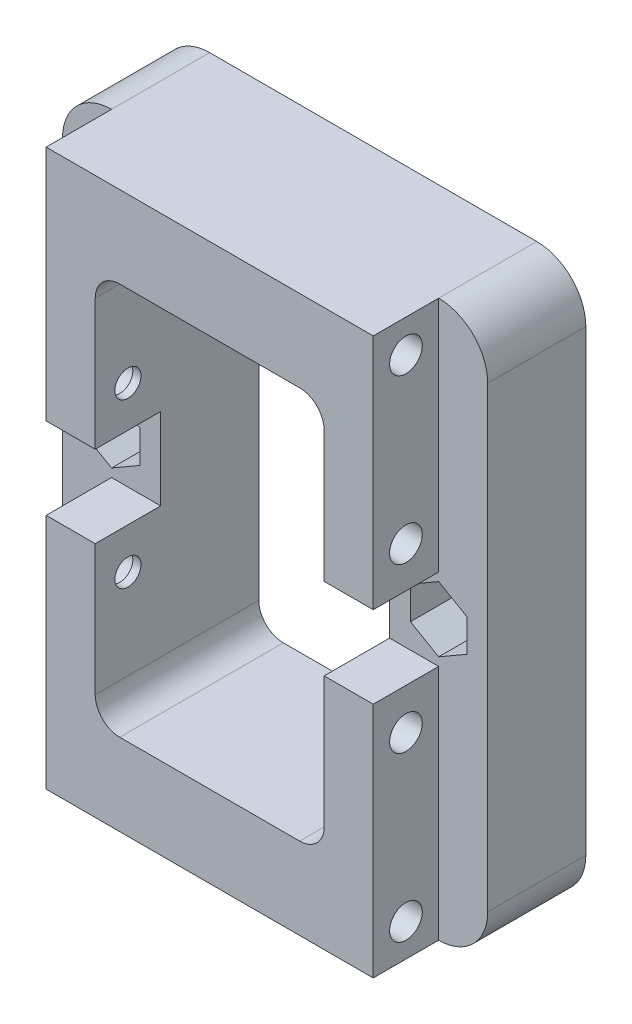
from build123d import *

# Parameters (mm, degrees)
SKETCH_1_W          = 52
SKETCH_1_H          = 68
SKETCH_1_R          = 2.1
EXTRUDE_1_DEPTH     = 12
CUT_EXTRUDE_1_DEPTH = 6.9
EXTRUDE_START       = 8
EXTRUDE_2_DEPTH     = 8
SKETCH_4_R          = 1.6
CUT_EXTRUDE_2_DEPTH = 59.446556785
SKETCH_5_R          = 2
CUT_EXTRUDE_3_DEPTH = 5
CUT_EXTRUDE_START   = -5
SKETCH_6_R          = 2
CUT_EXTRUDE_4_DEPTH = 5
FILLET_1_R          = 6


with BuildPart() as part:
    # Sketch 1 → Extrude 1 (new body)
    with BuildSketch(Plane.XY):
        Rectangle(SKETCH_1_W, SKETCH_1_H)
        with Locations((-20, 0)):
            Circle(SKETCH_1_R, mode=Mode.SUBTRACT)
        with Locations((20, 0)):
            Circle(SKETCH_1_R, mode=Mode.SUBTRACT)
        with BuildLine():
            Line((-11, 24), (11, 24))
            ThreePointArc((11, 24), (13.121320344, 23.121320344), (14, 21))
            Line((14, 21), (14, -21))
            ThreePointArc((14, -21), (13.121320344, -23.121320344), (11, -24))
            Line((11, -24), (-11, -24))
            ThreePointArc((-11, -24), (-13.121320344, -23.121320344), (-14, -21))
            Line((-14, -21), (-14, 21))
            ThreePointArc((-14, 21), (-13.121320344, 23.121320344), (-11, 24))
        make_face(mode=Mode.SUBTRACT)
    extrude(amount=-EXTRUDE_1_DEPTH)

    # Sketch 2 → Cut-Extrude 1 (cut)
    with BuildSketch(Plane.XY):
        Polygon((-20, 3.983716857), (-23.45, 1.991858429), (-23.45, -1.991858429), (-20, -3.983716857), (-16.55, -1.991858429), (-16.55, 1.991858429), align=None)
        Polygon((20, 3.983716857), (16.55, 1.991858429), (16.55, -1.991858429), (20, -3.983716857), (23.45, -1.991858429), (23.45, 1.991858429), align=None)
    extrude(amount=-CUT_EXTRUDE_1_DEPTH, mode=Mode.SUBTRACT)

    # Sketch 3 → Extrude 2 (add)
    with BuildSketch(Plane.XY.offset(EXTRUDE_START)):
        with BuildLine():
            Line((-14, 5), (-20, 5))
            Line((-20, 5), (-20, 34))
            Line((-20, 34), (20, 34))
            Line((20, 34), (20, 5))
            Line((20, 5), (14, 5))
            Line((14, 5), (14, 21))
            ThreePointArc((14, 21), (13.121320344, 23.121320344), (11, 24))
            Line((11, 24), (-11, 24))
            ThreePointArc((-11, 24), (-13.121320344, 23.121320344), (-14, 21))
            Line((-14, 21), (-14, 5))
        make_face()
        with BuildLine():
            Line((20, -5), (20, -34))
            Line((20, -34), (-20, -34))
            Line((-20, -34), (-20, -5))
            Line((-20, -5), (-14, -5))
            Line((-14, -5), (-14, -21))
            ThreePointArc((-14, -21), (-13.121320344, -23.121320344), (-11, -24))
            Line((-11, -24), (11, -24))
            ThreePointArc((11, -24), (13.121320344, -23.121320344), (14, -21))
            Line((14, -21), (14, -5))
            Line((14, -5), (20, -5))
        make_face()
    extrude(amount=-EXTRUDE_2_DEPTH)

    # Sketch 4 → Cut-Extrude 2 (cut, through all)
    with BuildSketch(Plane.ZY.offset(20)):
        with Locations((4, -30)):
            Circle(SKETCH_4_R)
        with Locations((4, -10)):
            Circle(SKETCH_4_R)
        with Locations((4, 10)):
            Circle(SKETCH_4_R)
        with Locations((4, 30)):
            Circle(SKETCH_4_R)
    extrude(amount=-CUT_EXTRUDE_2_DEPTH, mode=Mode.SUBTRACT)

    # Sketch 5 → Cut-Extrude 3 (cut)
    with BuildSketch(Plane.ZY.offset(20)):
        with Locations((4, -30)):
            Circle(SKETCH_5_R)
        with Locations((4, -10)):
            Circle(SKETCH_5_R)
        with Locations((4, 10)):
            Circle(SKETCH_5_R)
        with Locations((4, 30)):
            Circle(SKETCH_5_R)
    extrude(amount=-CUT_EXTRUDE_3_DEPTH, mode=Mode.SUBTRACT)

    # Sketch 6 → Cut-Extrude 4 (cut)
    with BuildSketch(Plane(origin=(20, 0, 0), x_dir=(0, 0, -1), z_dir=(1, 0, 0)).offset(CUT_EXTRUDE_START)):
        with Locations(Location((-4, -30, 0), (0, 0, 180))):
            Circle(SKETCH_6_R)
        with Locations(Location((-4, -10, 0), (0, 0, 180))):
            Circle(SKETCH_6_R)
        with Locations(Location((-4, 10, 0), (0, 0, 180))):
            Circle(SKETCH_6_R)
        with Locations(Location((-4, 30, 0), (0, 0, 180))):
            Circle(SKETCH_6_R)
    extrude(amount=CUT_EXTRUDE_4_DEPTH, mode=Mode.SUBTRACT)

    # Fillet 1
    fillet_1_edges = [part.edges().sort_by_distance(p)[0] for p in [
        (26, 34, -6),
        (-26, 34, -6),
        (-26, -34, -6),
        (26, -34, -6),
    ]]
    fillet(fillet_1_edges, radius=FILLET_1_R)


solid = part.part
